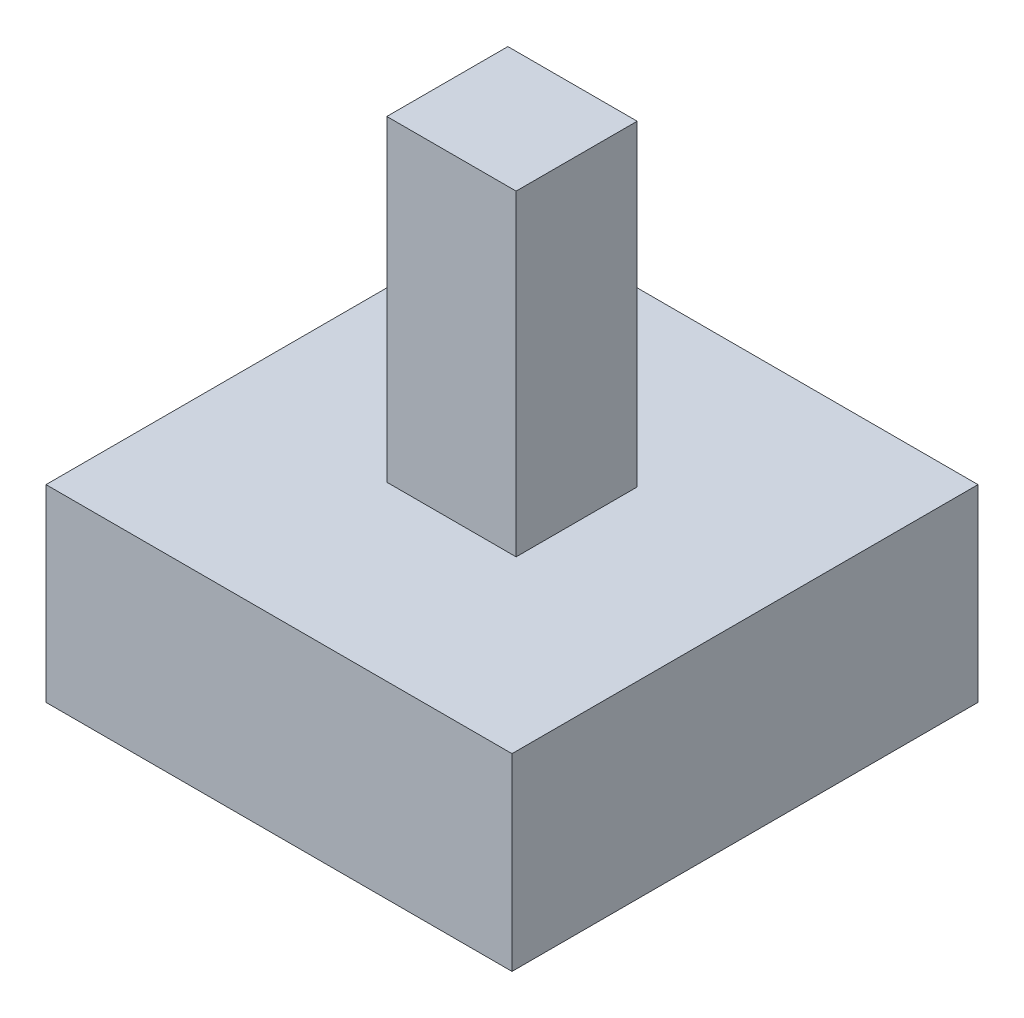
from build123d import *

# Parameters (mm, degrees)
SKETCH1_W      = 97.52724138
SKETCH1_H      = 97.52724138
EXTRUDE1_DEPTH = 39.473624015
SKETCH2_W      = 27.057243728
SKETCH2_H      = 25.334395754
EXTRUDE2_DEPTH = 66.296473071


with BuildPart() as part:
    # Sketch1 → Extrude1 (new body)
    with BuildSketch(Plane(origin=(0, 0, 0), x_dir=(1, 0, 0), z_dir=(0, 1, 0))):
        Rectangle(SKETCH1_W, SKETCH1_H)
    extrude(amount=EXTRUDE1_DEPTH)

    # Sketch2 → Extrude2 (add)
    with BuildSketch(Plane(origin=(0, 39.473624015, 0), x_dir=(-1, 0, 0), z_dir=(0, 1, 0))):
        Rectangle(SKETCH2_W, SKETCH2_H)
    extrude(amount=EXTRUDE2_DEPTH)


solid = part.part
